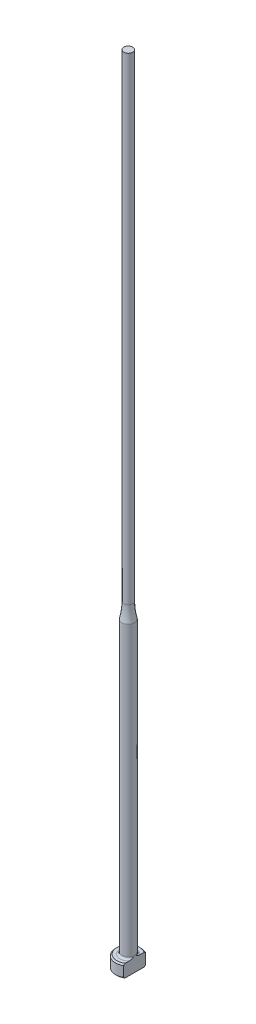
from build123d import *
from build123d.topology import SkipClean

# Parameters (mm, degrees)
CHAMFER1_SIZE = 0.2
FILLET1_R     = 0.3
KEY_DEPTH     = 126.031995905


with BuildPart() as part:
    # Sketch1 → Revolve1 (revolve)
    with BuildSketch(Plane.XY, mode=Mode.PRIVATE) as revolve1_sk:
        with BuildLine():
            Line((0, 0), (-2, 0))
            Line((-2, 0), (-2, 2))
            Line((-2, 2), (-1, 2))
            Line((-1, 2), (-1, 47.568950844))
            ThreePointArc((-1, 47.568950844), (-0.775283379, 48.775255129), (-0.7, 50))
            Line((-0.7, 50), (-0.7, 125))
            Line((-0.7, 125), (0, 125))
            Line((0, 125), (0, 0))
        make_face()
    revolve(revolve1_sk.sketch.rotate(Axis((0, 259.958771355, 0), (0, -1, 0)), 270), axis=Axis((0, 259.958771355, 0), (0, -1, 0)))

    # Chamfer1
    chamfer1_edges = [part.edges().sort_by_distance(p)[0] for p in [
        (0, 0, -2),
        (0, 2, -2),
    ]]
    chamfer(chamfer1_edges, length=CHAMFER1_SIZE)

    # Fillet1
    fillet1_edges = [part.edges().sort_by_distance(p)[0] for p in [
        (0, 2, -1),
    ]]
    fillet(fillet1_edges, radius=FILLET1_R)

    # Sketch2 → KEY (cut, through all)
    with SkipClean():  # the faces are left unmerged after this step: merging them gives an invalid solid
        with BuildSketch(Plane(origin=(0, 0, 0), x_dir=(1, 0, 0), z_dir=(0, 1, 0))):
            with BuildLine():
                Line((1, 1.732050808), (1, -1.732050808))
                ThreePointArc((1, -1.732050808), (2, 0), (1, 1.732050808))
            make_face()
        extrude(amount=KEY_DEPTH, mode=Mode.SUBTRACT)


solid = part.part
